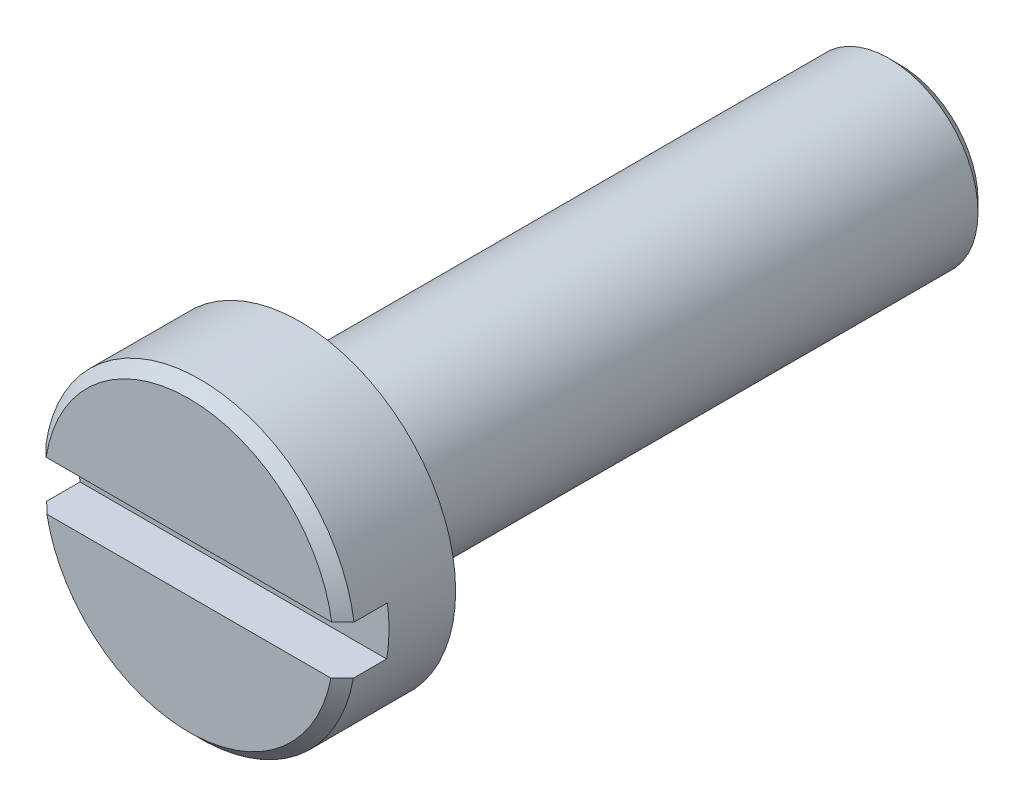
from build123d import *

# Parameters (mm, degrees)
CHAMFER1_SIZE      = 1.5875
CUT_EXTRUDE1_START = -6.35
CUT_EXTRUDE1_DEPTH = 6.35


with BuildPart() as part:
    # Sketch1 → Revolve2 (revolve)
    with BuildSketch(Plane(origin=(0, 0, 0), x_dir=(0, 0, -1), z_dir=(1, 0, 0)), mode=Mode.PRIVATE) as revolve2_sk:
        Polygon((0, 0), (0, 22.225), (15.875, 22.225), (15.875, 12.7), (101.6, 12.7), (101.6, 0), align=None)
    revolve(revolve2_sk.sketch.rotate(Axis((0, 0, 0), (0, 0, -1)), 90), axis=Axis((0, 0, 0), (0, 0, -1)))

    # Chamfer1
    chamfer1_edges = [part.edges().sort_by_distance(p)[0] for p in [
        (-12.7, 0, -101.6),
        (-22.225, 0, 0),
    ]]
    chamfer(chamfer1_edges, length=CHAMFER1_SIZE)

    # Sketch2 → Cut-Extrude1 (cut)
    with BuildSketch(Plane.XY.offset(CUT_EXTRUDE1_START)):
        with BuildLine():
            Line((-21.997045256, 3.175), (21.997045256, 3.175))
            ThreePointArc((21.997045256, 3.175), (22.222674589, -0.321495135), (21.895993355, -3.81))
            Line((21.895993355, -3.81), (-21.895993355, -3.81))
            ThreePointArc((-21.895993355, -3.81), (-22.222674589, -0.321495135), (-21.997045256, 3.175))
        make_face()
    extrude(amount=CUT_EXTRUDE1_DEPTH, mode=Mode.SUBTRACT)


solid = part.part
